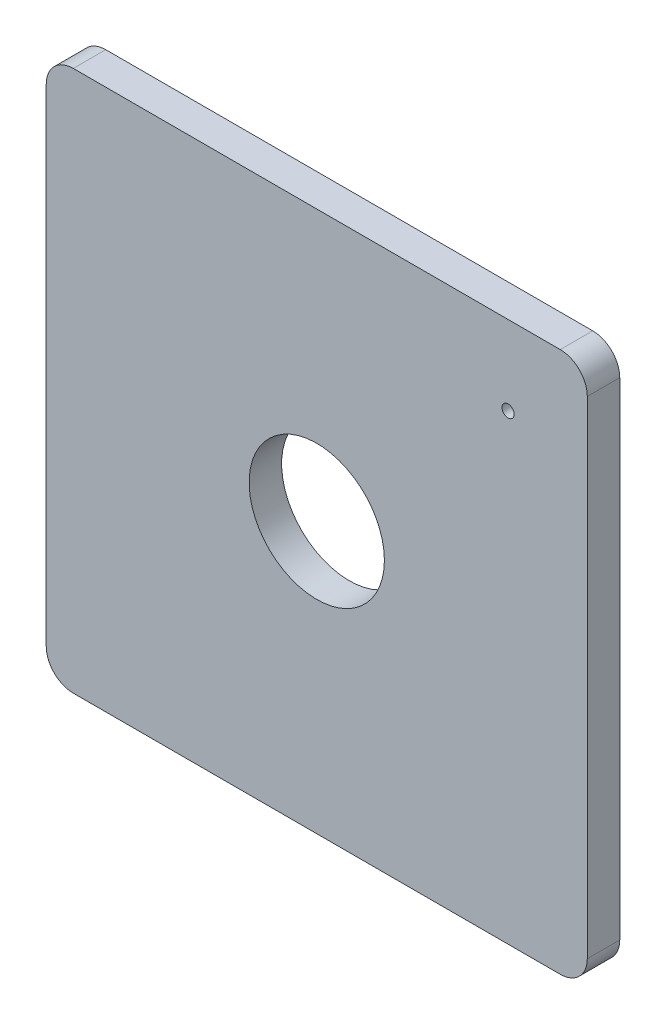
ISO-10303-21;
HEADER;
FILE_DESCRIPTION(('STEP AP214'),'2;1');
FILE_NAME('part.step','',(''),(''),'','','');
FILE_SCHEMA(('AUTOMOTIVE_DESIGN { 1 0 10303 214 1 1 1 1 }'));
ENDSEC;
DATA;
#1=APPLICATION_CONTEXT('core data for automotive mechanical design processes');
#2=APPLICATION_PROTOCOL_DEFINITION('international standard','automotive_design',2000,#1);
#3=PRODUCT_CONTEXT('',#1,'mechanical');
#4=PRODUCT('Part','Part','',(#3));
#5=PRODUCT_RELATED_PRODUCT_CATEGORY('part','',(#4));
#6=PRODUCT_DEFINITION_FORMATION('','',#4);
#7=PRODUCT_DEFINITION_CONTEXT('part definition',#1,'design');
#8=PRODUCT_DEFINITION('design','',#6,#7);
#9=PRODUCT_DEFINITION_SHAPE('','',#8);
#10=(LENGTH_UNIT() NAMED_UNIT(*) SI_UNIT(.MILLI.,.METRE.));
#11=(NAMED_UNIT(*) PLANE_ANGLE_UNIT() SI_UNIT($,.RADIAN.));
#12=(NAMED_UNIT(*) SI_UNIT($,.STERADIAN.) SOLID_ANGLE_UNIT());
#13=UNCERTAINTY_MEASURE_WITH_UNIT(LENGTH_MEASURE(1.E-05),#10,'distance_accuracy_value','');
#14=(GEOMETRIC_REPRESENTATION_CONTEXT(3) GLOBAL_UNCERTAINTY_ASSIGNED_CONTEXT((#13)) GLOBAL_UNIT_ASSIGNED_CONTEXT((#10,
#11,#12)) REPRESENTATION_CONTEXT('',''));
#15=CARTESIAN_POINT('',(0.,0.,0.));
#16=DIRECTION('',(0.,0.,1.));
#17=DIRECTION('',(1.,0.,0.));
#18=AXIS2_PLACEMENT_3D('',#15,#16,#17);
#19=CARTESIAN_POINT('',(0.,-200.,12.));
#20=DIRECTION('',(0.,0.,1.));
#21=DIRECTION('',(1.,0.,0.));
#22=AXIS2_PLACEMENT_3D('',#19,#20,#21);
#23=PLANE('',#22);
#24=CARTESIAN_POINT('',(170.710678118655,-29.2893218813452,12.));
#25=DIRECTION('',(0.,0.,1.));
#26=DIRECTION('',(1.,0.,0.));
#27=AXIS2_PLACEMENT_3D('',#24,#25,#26);
#28=CIRCLE('',#27,2.25000000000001);
#29=CARTESIAN_POINT('',(172.960678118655,-29.2893218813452,12.));
#30=VERTEX_POINT('',#29);
#31=EDGE_CURVE('E184',#30,#30,#28,.T.);
#32=ORIENTED_EDGE('',*,*,#31,.F.);
#33=EDGE_LOOP('',(#32));
#34=FACE_BOUND('',#33,.T.);
#35=DIRECTION('',(0.,-1.,0.));
#36=VECTOR('',#35,1.);
#37=CARTESIAN_POINT('',(0.,0.,12.));
#38=LINE('',#37,#36);
#39=CARTESIAN_POINT('',(0.,-10.,12.));
#40=VERTEX_POINT('',#39);
#41=CARTESIAN_POINT('',(0.,-190.,12.));
#42=VERTEX_POINT('',#41);
#43=EDGE_CURVE('E135',#40,#42,#38,.T.);
#44=ORIENTED_EDGE('',*,*,#43,.T.);
#45=CARTESIAN_POINT('',(10.,-190.,12.));
#46=DIRECTION('',(0.,0.,1.));
#47=DIRECTION('',(1.,0.,0.));
#48=AXIS2_PLACEMENT_3D('',#45,#46,#47);
#49=CIRCLE('',#48,10.);
#50=CARTESIAN_POINT('',(10.,-200.,12.));
#51=VERTEX_POINT('',#50);
#52=EDGE_CURVE('E156',#42,#51,#49,.T.);
#53=ORIENTED_EDGE('',*,*,#52,.T.);
#54=DIRECTION('',(1.,0.,0.));
#55=VECTOR('',#54,1.);
#56=CARTESIAN_POINT('',(0.,-200.,12.));
#57=LINE('',#56,#55);
#58=CARTESIAN_POINT('',(190.,-200.,12.));
#59=VERTEX_POINT('',#58);
#60=EDGE_CURVE('E117',#51,#59,#57,.T.);
#61=ORIENTED_EDGE('',*,*,#60,.T.);
#62=CARTESIAN_POINT('',(190.,-190.,12.));
#63=DIRECTION('',(0.,0.,1.));
#64=DIRECTION('',(1.,0.,0.));
#65=AXIS2_PLACEMENT_3D('',#62,#63,#64);
#66=CIRCLE('',#65,10.);
#67=CARTESIAN_POINT('',(200.,-190.,12.));
#68=VERTEX_POINT('',#67);
#69=EDGE_CURVE('E154',#59,#68,#66,.T.);
#70=ORIENTED_EDGE('',*,*,#69,.T.);
#71=DIRECTION('',(0.,1.,0.));
#72=VECTOR('',#71,1.);
#73=CARTESIAN_POINT('',(200.,0.,12.));
#74=LINE('',#73,#72);
#75=CARTESIAN_POINT('',(200.,-10.,12.));
#76=VERTEX_POINT('',#75);
#77=EDGE_CURVE('E167',#68,#76,#74,.T.);
#78=ORIENTED_EDGE('',*,*,#77,.T.);
#79=CARTESIAN_POINT('',(190.,-10.,12.));
#80=DIRECTION('',(0.,0.,1.));
#81=DIRECTION('',(1.,0.,0.));
#82=AXIS2_PLACEMENT_3D('',#79,#80,#81);
#83=CIRCLE('',#82,10.);
#84=CARTESIAN_POINT('',(190.,0.,12.));
#85=VERTEX_POINT('',#84);
#86=EDGE_CURVE('E52',#76,#85,#83,.T.);
#87=ORIENTED_EDGE('',*,*,#86,.T.);
#88=DIRECTION('',(-1.,0.,0.));
#89=VECTOR('',#88,1.);
#90=CARTESIAN_POINT('',(0.,0.,12.));
#91=LINE('',#90,#89);
#92=CARTESIAN_POINT('',(10.,0.,12.));
#93=VERTEX_POINT('',#92);
#94=EDGE_CURVE('E140',#85,#93,#91,.T.);
#95=ORIENTED_EDGE('',*,*,#94,.T.);
#96=CARTESIAN_POINT('',(10.,-10.,12.));
#97=DIRECTION('',(0.,0.,1.));
#98=DIRECTION('',(1.,0.,0.));
#99=AXIS2_PLACEMENT_3D('',#96,#97,#98);
#100=CIRCLE('',#99,10.);
#101=EDGE_CURVE('E151',#93,#40,#100,.T.);
#102=ORIENTED_EDGE('',*,*,#101,.T.);
#103=EDGE_LOOP('',(#44,#53,#61,#70,#78,#87,#95,#102));
#104=FACE_BOUND('',#103,.T.);
#105=CARTESIAN_POINT('',(100.,-100.,12.));
#106=DIRECTION('',(0.,0.,1.));
#107=DIRECTION('',(1.,0.,0.));
#108=AXIS2_PLACEMENT_3D('',#105,#106,#107);
#109=CIRCLE('',#108,25.);
#110=CARTESIAN_POINT('',(125.,-100.,12.));
#111=VERTEX_POINT('',#110);
#112=EDGE_CURVE('E130',#111,#111,#109,.T.);
#113=ORIENTED_EDGE('',*,*,#112,.F.);
#114=EDGE_LOOP('',(#113));
#115=FACE_BOUND('',#114,.T.);
#116=ADVANCED_FACE('F31',(#34,#104,#115),#23,.T.);
#117=CARTESIAN_POINT('',(0.,-200.,0.));
#118=DIRECTION('',(0.,0.,1.));
#119=DIRECTION('',(1.,0.,0.));
#120=AXIS2_PLACEMENT_3D('',#117,#118,#119);
#121=PLANE('',#120);
#122=CARTESIAN_POINT('',(170.710678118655,-29.2893218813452,0.));
#123=DIRECTION('',(0.,0.,1.));
#124=DIRECTION('',(1.,0.,0.));
#125=AXIS2_PLACEMENT_3D('',#122,#123,#124);
#126=CIRCLE('',#125,6.25000000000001);
#127=CARTESIAN_POINT('',(176.960678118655,-29.2893218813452,0.));
#128=VERTEX_POINT('',#127);
#129=EDGE_CURVE('E136',#128,#128,#126,.T.);
#130=ORIENTED_EDGE('',*,*,#129,.T.);
#131=EDGE_LOOP('',(#130));
#132=FACE_BOUND('',#131,.T.);
#133=DIRECTION('',(1.,0.,0.));
#134=VECTOR('',#133,1.);
#135=CARTESIAN_POINT('',(0.,-200.,0.));
#136=LINE('',#135,#134);
#137=CARTESIAN_POINT('',(10.,-200.,0.));
#138=VERTEX_POINT('',#137);
#139=CARTESIAN_POINT('',(190.,-200.,0.));
#140=VERTEX_POINT('',#139);
#141=EDGE_CURVE('E114',#138,#140,#136,.T.);
#142=ORIENTED_EDGE('',*,*,#141,.F.);
#143=CARTESIAN_POINT('',(10.,-190.,0.));
#144=DIRECTION('',(0.,0.,1.));
#145=DIRECTION('',(1.,0.,0.));
#146=AXIS2_PLACEMENT_3D('',#143,#144,#145);
#147=CIRCLE('',#146,10.);
#148=CARTESIAN_POINT('',(0.,-190.,0.));
#149=VERTEX_POINT('',#148);
#150=EDGE_CURVE('E97',#138,#149,#147,.F.);
#151=ORIENTED_EDGE('',*,*,#150,.T.);
#152=DIRECTION('',(0.,-1.,0.));
#153=VECTOR('',#152,1.);
#154=CARTESIAN_POINT('',(0.,0.,0.));
#155=LINE('',#154,#153);
#156=CARTESIAN_POINT('',(0.,-10.,0.));
#157=VERTEX_POINT('',#156);
#158=EDGE_CURVE('E125',#157,#149,#155,.T.);
#159=ORIENTED_EDGE('',*,*,#158,.F.);
#160=CARTESIAN_POINT('',(10.,-10.,0.));
#161=DIRECTION('',(0.,0.,1.));
#162=DIRECTION('',(1.,0.,0.));
#163=AXIS2_PLACEMENT_3D('',#160,#161,#162);
#164=CIRCLE('',#163,10.);
#165=CARTESIAN_POINT('',(10.,0.,0.));
#166=VERTEX_POINT('',#165);
#167=EDGE_CURVE('E118',#157,#166,#164,.F.);
#168=ORIENTED_EDGE('',*,*,#167,.T.);
#169=DIRECTION('',(-1.,0.,0.));
#170=VECTOR('',#169,1.);
#171=CARTESIAN_POINT('',(0.,0.,0.));
#172=LINE('',#171,#170);
#173=CARTESIAN_POINT('',(190.,0.,0.));
#174=VERTEX_POINT('',#173);
#175=EDGE_CURVE('E128',#174,#166,#172,.T.);
#176=ORIENTED_EDGE('',*,*,#175,.F.);
#177=CARTESIAN_POINT('',(190.,-10.,0.));
#178=DIRECTION('',(0.,0.,1.));
#179=DIRECTION('',(1.,0.,0.));
#180=AXIS2_PLACEMENT_3D('',#177,#178,#179);
#181=CIRCLE('',#180,10.);
#182=CARTESIAN_POINT('',(200.,-10.,0.));
#183=VERTEX_POINT('',#182);
#184=EDGE_CURVE('E145',#174,#183,#181,.F.);
#185=ORIENTED_EDGE('',*,*,#184,.T.);
#186=DIRECTION('',(0.,1.,0.));
#187=VECTOR('',#186,1.);
#188=CARTESIAN_POINT('',(200.,0.,0.));
#189=LINE('',#188,#187);
#190=CARTESIAN_POINT('',(200.,-190.,0.));
#191=VERTEX_POINT('',#190);
#192=EDGE_CURVE('E124',#191,#183,#189,.T.);
#193=ORIENTED_EDGE('',*,*,#192,.F.);
#194=CARTESIAN_POINT('',(190.,-190.,0.));
#195=DIRECTION('',(0.,0.,1.));
#196=DIRECTION('',(1.,0.,0.));
#197=AXIS2_PLACEMENT_3D('',#194,#195,#196);
#198=CIRCLE('',#197,10.);
#199=EDGE_CURVE('E108',#191,#140,#198,.F.);
#200=ORIENTED_EDGE('',*,*,#199,.T.);
#201=EDGE_LOOP('',(#142,#151,#159,#168,#176,#185,#193,#200));
#202=FACE_BOUND('',#201,.T.);
#203=CARTESIAN_POINT('',(100.,-100.,0.));
#204=DIRECTION('',(0.,0.,1.));
#205=DIRECTION('',(1.,0.,0.));
#206=AXIS2_PLACEMENT_3D('',#203,#204,#205);
#207=CIRCLE('',#206,25.);
#208=CARTESIAN_POINT('',(125.,-100.,0.));
#209=VERTEX_POINT('',#208);
#210=EDGE_CURVE('E181',#209,#209,#207,.T.);
#211=ORIENTED_EDGE('',*,*,#210,.T.);
#212=EDGE_LOOP('',(#211));
#213=FACE_BOUND('',#212,.T.);
#214=ADVANCED_FACE('F121',(#132,#202,#213),#121,.F.);
#215=CARTESIAN_POINT('',(0.,0.,12.));
#216=DIRECTION('',(1.,0.,0.));
#217=DIRECTION('',(0.,1.,0.));
#218=AXIS2_PLACEMENT_3D('',#215,#216,#217);
#219=PLANE('',#218);
#220=ORIENTED_EDGE('',*,*,#158,.T.);
#221=DIRECTION('',(0.,0.,-1.));
#222=VECTOR('',#221,1.);
#223=CARTESIAN_POINT('',(0.,-190.,12.));
#224=LINE('',#223,#222);
#225=EDGE_CURVE('E102',#149,#42,#224,.F.);
#226=ORIENTED_EDGE('',*,*,#225,.T.);
#227=ORIENTED_EDGE('',*,*,#43,.F.);
#228=DIRECTION('',(0.,0.,-1.));
#229=VECTOR('',#228,1.);
#230=CARTESIAN_POINT('',(0.,-10.,12.));
#231=LINE('',#230,#229);
#232=EDGE_CURVE('E107',#40,#157,#231,.T.);
#233=ORIENTED_EDGE('',*,*,#232,.T.);
#234=EDGE_LOOP('',(#220,#226,#227,#233));
#235=FACE_BOUND('',#234,.T.);
#236=ADVANCED_FACE('F204',(#235),#219,.F.);
#237=CARTESIAN_POINT('',(0.,-200.,12.));
#238=DIRECTION('',(0.,1.,0.));
#239=DIRECTION('',(0.,0.,1.));
#240=AXIS2_PLACEMENT_3D('',#237,#238,#239);
#241=PLANE('',#240);
#242=ORIENTED_EDGE('',*,*,#60,.F.);
#243=DIRECTION('',(0.,0.,-1.));
#244=VECTOR('',#243,1.);
#245=CARTESIAN_POINT('',(10.,-200.,12.));
#246=LINE('',#245,#244);
#247=EDGE_CURVE('E101',#51,#138,#246,.T.);
#248=ORIENTED_EDGE('',*,*,#247,.T.);
#249=ORIENTED_EDGE('',*,*,#141,.T.);
#250=DIRECTION('',(0.,0.,-1.));
#251=VECTOR('',#250,1.);
#252=CARTESIAN_POINT('',(190.,-200.,12.));
#253=LINE('',#252,#251);
#254=EDGE_CURVE('E119',#140,#59,#253,.F.);
#255=ORIENTED_EDGE('',*,*,#254,.T.);
#256=EDGE_LOOP('',(#242,#248,#249,#255));
#257=FACE_BOUND('',#256,.T.);
#258=ADVANCED_FACE('F113',(#257),#241,.F.);
#259=CARTESIAN_POINT('',(200.,0.,12.));
#260=DIRECTION('',(-1.,0.,0.));
#261=DIRECTION('',(0.,-1.,0.));
#262=AXIS2_PLACEMENT_3D('',#259,#260,#261);
#263=PLANE('',#262);
#264=ORIENTED_EDGE('',*,*,#77,.F.);
#265=DIRECTION('',(0.,0.,-1.));
#266=VECTOR('',#265,1.);
#267=CARTESIAN_POINT('',(200.,-190.,12.));
#268=LINE('',#267,#266);
#269=EDGE_CURVE('E160',#68,#191,#268,.T.);
#270=ORIENTED_EDGE('',*,*,#269,.T.);
#271=ORIENTED_EDGE('',*,*,#192,.T.);
#272=DIRECTION('',(0.,0.,-1.));
#273=VECTOR('',#272,1.);
#274=CARTESIAN_POINT('',(200.,-10.,12.));
#275=LINE('',#274,#273);
#276=EDGE_CURVE('E158',#183,#76,#275,.F.);
#277=ORIENTED_EDGE('',*,*,#276,.T.);
#278=EDGE_LOOP('',(#264,#270,#271,#277));
#279=FACE_BOUND('',#278,.T.);
#280=ADVANCED_FACE('F165',(#279),#263,.F.);
#281=CARTESIAN_POINT('',(0.,0.,12.));
#282=DIRECTION('',(0.,-1.,0.));
#283=DIRECTION('',(0.,0.,-1.));
#284=AXIS2_PLACEMENT_3D('',#281,#282,#283);
#285=PLANE('',#284);
#286=ORIENTED_EDGE('',*,*,#94,.F.);
#287=DIRECTION('',(0.,0.,-1.));
#288=VECTOR('',#287,1.);
#289=CARTESIAN_POINT('',(190.,0.,12.));
#290=LINE('',#289,#288);
#291=EDGE_CURVE('E11',#85,#174,#290,.T.);
#292=ORIENTED_EDGE('',*,*,#291,.T.);
#293=ORIENTED_EDGE('',*,*,#175,.T.);
#294=DIRECTION('',(0.,0.,-1.));
#295=VECTOR('',#294,1.);
#296=CARTESIAN_POINT('',(10.,0.,12.));
#297=LINE('',#296,#295);
#298=EDGE_CURVE('E39',#166,#93,#297,.F.);
#299=ORIENTED_EDGE('',*,*,#298,.T.);
#300=EDGE_LOOP('',(#286,#292,#293,#299));
#301=FACE_BOUND('',#300,.T.);
#302=ADVANCED_FACE('F174',(#301),#285,.F.);
#303=CARTESIAN_POINT('',(100.,-100.,12.));
#304=DIRECTION('',(0.,0.,-1.));
#305=DIRECTION('',(-1.,0.,0.));
#306=AXIS2_PLACEMENT_3D('',#303,#304,#305);
#307=CYLINDRICAL_SURFACE('',#306,25.);
#308=ORIENTED_EDGE('',*,*,#112,.T.);
#309=EDGE_LOOP('',(#308));
#310=FACE_BOUND('',#309,.T.);
#311=ORIENTED_EDGE('',*,*,#210,.F.);
#312=EDGE_LOOP('',(#311));
#313=FACE_BOUND('',#312,.T.);
#314=ADVANCED_FACE('F198',(#310,#313),#307,.F.);
#315=CARTESIAN_POINT('',(170.710678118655,-29.2893218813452,0.));
#316=DIRECTION('',(0.,0.,1.));
#317=DIRECTION('',(1.,0.,0.));
#318=AXIS2_PLACEMENT_3D('',#315,#316,#317);
#319=CYLINDRICAL_SURFACE('',#318,2.25000000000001);
#320=CARTESIAN_POINT('',(170.710678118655,-29.2893218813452,4.00000000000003));
#321=DIRECTION('',(0.,0.,1.));
#322=DIRECTION('',(1.,0.,0.));
#323=AXIS2_PLACEMENT_3D('',#320,#321,#322);
#324=CIRCLE('',#323,2.25000000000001);
#325=CARTESIAN_POINT('',(172.960678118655,-29.2893218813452,4.00000000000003));
#326=VERTEX_POINT('',#325);
#327=EDGE_CURVE('E139',#326,#326,#324,.F.);
#328=ORIENTED_EDGE('',*,*,#327,.T.);
#329=EDGE_LOOP('',(#328));
#330=FACE_BOUND('',#329,.T.);
#331=ORIENTED_EDGE('',*,*,#31,.T.);
#332=EDGE_LOOP('',(#331));
#333=FACE_BOUND('',#332,.T.);
#334=ADVANCED_FACE('F190',(#330,#333),#319,.F.);
#335=CARTESIAN_POINT('',(170.710678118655,-29.2893218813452,0.));
#336=DIRECTION('',(0.,0.,-1.));
#337=DIRECTION('',(-1.,0.,0.));
#338=AXIS2_PLACEMENT_3D('',#335,#336,#337);
#339=CONICAL_SURFACE('',#338,6.25000000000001,0.785398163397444);
#340=ORIENTED_EDGE('',*,*,#327,.F.);
#341=EDGE_LOOP('',(#340));
#342=FACE_BOUND('',#341,.T.);
#343=ORIENTED_EDGE('',*,*,#129,.F.);
#344=EDGE_LOOP('',(#343));
#345=FACE_BOUND('',#344,.T.);
#346=ADVANCED_FACE('F219',(#342,#345),#339,.F.);
#347=CARTESIAN_POINT('',(10.,-190.,12.));
#348=DIRECTION('',(0.,0.,-1.));
#349=DIRECTION('',(-1.,0.,0.));
#350=AXIS2_PLACEMENT_3D('',#347,#348,#349);
#351=CYLINDRICAL_SURFACE('',#350,10.);
#352=ORIENTED_EDGE('',*,*,#52,.F.);
#353=ORIENTED_EDGE('',*,*,#225,.F.);
#354=ORIENTED_EDGE('',*,*,#150,.F.);
#355=ORIENTED_EDGE('',*,*,#247,.F.);
#356=EDGE_LOOP('',(#352,#353,#354,#355));
#357=FACE_BOUND('',#356,.T.);
#358=ADVANCED_FACE('F100',(#357),#351,.T.);
#359=CARTESIAN_POINT('',(190.,-190.,12.));
#360=DIRECTION('',(0.,0.,-1.));
#361=DIRECTION('',(-1.,0.,0.));
#362=AXIS2_PLACEMENT_3D('',#359,#360,#361);
#363=CYLINDRICAL_SURFACE('',#362,10.);
#364=ORIENTED_EDGE('',*,*,#69,.F.);
#365=ORIENTED_EDGE('',*,*,#254,.F.);
#366=ORIENTED_EDGE('',*,*,#199,.F.);
#367=ORIENTED_EDGE('',*,*,#269,.F.);
#368=EDGE_LOOP('',(#364,#365,#366,#367));
#369=FACE_BOUND('',#368,.T.);
#370=ADVANCED_FACE('F225',(#369),#363,.T.);
#371=CARTESIAN_POINT('',(190.,-10.,12.));
#372=DIRECTION('',(0.,0.,-1.));
#373=DIRECTION('',(-1.,0.,0.));
#374=AXIS2_PLACEMENT_3D('',#371,#372,#373);
#375=CYLINDRICAL_SURFACE('',#374,10.);
#376=ORIENTED_EDGE('',*,*,#86,.F.);
#377=ORIENTED_EDGE('',*,*,#276,.F.);
#378=ORIENTED_EDGE('',*,*,#184,.F.);
#379=ORIENTED_EDGE('',*,*,#291,.F.);
#380=EDGE_LOOP('',(#376,#377,#378,#379));
#381=FACE_BOUND('',#380,.T.);
#382=ADVANCED_FACE('F173',(#381),#375,.T.);
#383=CARTESIAN_POINT('',(10.,-10.,12.));
#384=DIRECTION('',(0.,0.,-1.));
#385=DIRECTION('',(-1.,0.,0.));
#386=AXIS2_PLACEMENT_3D('',#383,#384,#385);
#387=CYLINDRICAL_SURFACE('',#386,10.);
#388=ORIENTED_EDGE('',*,*,#101,.F.);
#389=ORIENTED_EDGE('',*,*,#298,.F.);
#390=ORIENTED_EDGE('',*,*,#167,.F.);
#391=ORIENTED_EDGE('',*,*,#232,.F.);
#392=EDGE_LOOP('',(#388,#389,#390,#391));
#393=FACE_BOUND('',#392,.T.);
#394=ADVANCED_FACE('F33',(#393),#387,.T.);
#395=CLOSED_SHELL('',(#116,#214,#236,#258,#280,#302,#314,#334,#346,#358,#370,#382,#394));
#396=MANIFOLD_SOLID_BREP('B2',#395);
#397=ADVANCED_BREP_SHAPE_REPRESENTATION('',(#18,#396),#14);
#398=SHAPE_DEFINITION_REPRESENTATION(#9,#397);
ENDSEC;
END-ISO-10303-21;
